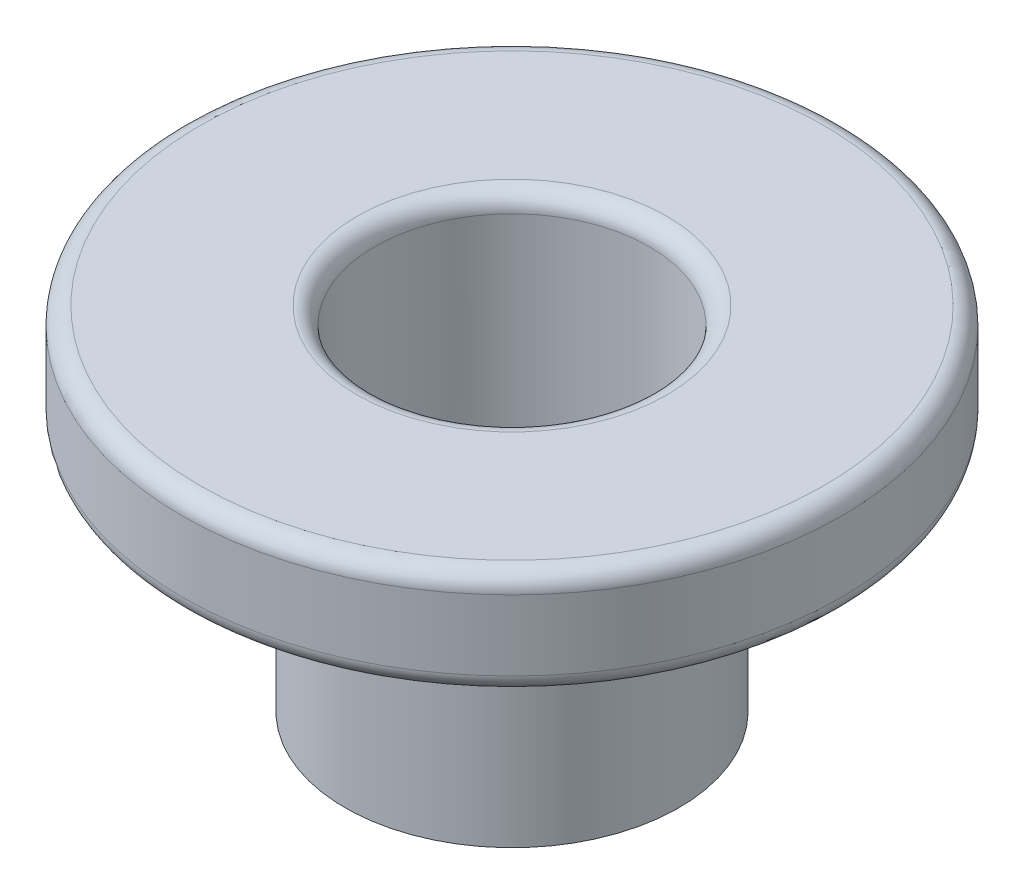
ISO-10303-21;
HEADER;
FILE_DESCRIPTION(('STEP AP214'),'2;1');
FILE_NAME('part.step','',(''),(''),'','','');
FILE_SCHEMA(('AUTOMOTIVE_DESIGN { 1 0 10303 214 1 1 1 1 }'));
ENDSEC;
DATA;
#1=APPLICATION_CONTEXT('core data for automotive mechanical design processes');
#2=APPLICATION_PROTOCOL_DEFINITION('international standard','automotive_design',2000,#1);
#3=PRODUCT_CONTEXT('',#1,'mechanical');
#4=PRODUCT('Part','Part','',(#3));
#5=PRODUCT_RELATED_PRODUCT_CATEGORY('part','',(#4));
#6=PRODUCT_DEFINITION_FORMATION('','',#4);
#7=PRODUCT_DEFINITION_CONTEXT('part definition',#1,'design');
#8=PRODUCT_DEFINITION('design','',#6,#7);
#9=PRODUCT_DEFINITION_SHAPE('','',#8);
#10=(LENGTH_UNIT() NAMED_UNIT(*) SI_UNIT(.MILLI.,.METRE.));
#11=(NAMED_UNIT(*) PLANE_ANGLE_UNIT() SI_UNIT($,.RADIAN.));
#12=(NAMED_UNIT(*) SI_UNIT($,.STERADIAN.) SOLID_ANGLE_UNIT());
#13=UNCERTAINTY_MEASURE_WITH_UNIT(LENGTH_MEASURE(1.E-05),#10,'distance_accuracy_value','');
#14=(GEOMETRIC_REPRESENTATION_CONTEXT(3) GLOBAL_UNCERTAINTY_ASSIGNED_CONTEXT((#13)) GLOBAL_UNIT_ASSIGNED_CONTEXT((#10,
#11,#12)) REPRESENTATION_CONTEXT('',''));
#15=CARTESIAN_POINT('',(0.,0.,0.));
#16=DIRECTION('',(0.,0.,1.));
#17=DIRECTION('',(1.,0.,0.));
#18=AXIS2_PLACEMENT_3D('',#15,#16,#17);
#19=CARTESIAN_POINT('',(2.413,0.,0.));
#20=DIRECTION('',(0.,-1.,0.));
#21=DIRECTION('',(0.,0.,-1.));
#22=AXIS2_PLACEMENT_3D('',#19,#20,#21);
#23=PLANE('',#22);
#24=CARTESIAN_POINT('',(0.,0.,0.));
#25=DIRECTION('',(0.,-1.,0.));
#26=DIRECTION('',(0.,0.,-1.));
#27=AXIS2_PLACEMENT_3D('',#24,#25,#26);
#28=CIRCLE('',#27,2.413);
#29=CARTESIAN_POINT('',(0.,0.,-2.413));
#30=VERTEX_POINT('',#29);
#31=EDGE_CURVE('E49',#30,#30,#28,.T.);
#32=ORIENTED_EDGE('',*,*,#31,.T.);
#33=EDGE_LOOP('',(#32));
#34=FACE_BOUND('',#33,.T.);
#35=CARTESIAN_POINT('',(0.,0.,0.));
#36=DIRECTION('',(0.,-1.,0.));
#37=DIRECTION('',(0.,0.,-1.));
#38=AXIS2_PLACEMENT_3D('',#35,#36,#37);
#39=CIRCLE('',#38,1.984375);
#40=CARTESIAN_POINT('',(0.,0.,-1.984375));
#41=VERTEX_POINT('',#40);
#42=EDGE_CURVE('E55',#41,#41,#39,.T.);
#43=ORIENTED_EDGE('',*,*,#42,.F.);
#44=EDGE_LOOP('',(#43));
#45=FACE_BOUND('',#44,.T.);
#46=ADVANCED_FACE('F24',(#34,#45),#23,.T.);
#47=CARTESIAN_POINT('',(0.,0.,0.));
#48=DIRECTION('',(0.,-1.,0.));
#49=DIRECTION('',(0.,0.,-1.));
#50=AXIS2_PLACEMENT_3D('',#47,#48,#49);
#51=CYLINDRICAL_SURFACE('',#50,2.413);
#52=CARTESIAN_POINT('',(0.,3.556,0.));
#53=DIRECTION('',(0.,-1.,0.));
#54=DIRECTION('',(0.,0.,-1.));
#55=AXIS2_PLACEMENT_3D('',#52,#53,#54);
#56=CIRCLE('',#55,2.413);
#57=CARTESIAN_POINT('',(0.,3.556,-2.413));
#58=VERTEX_POINT('',#57);
#59=EDGE_CURVE('E52',#58,#58,#56,.T.);
#60=ORIENTED_EDGE('',*,*,#59,.T.);
#61=EDGE_LOOP('',(#60));
#62=FACE_BOUND('',#61,.T.);
#63=ORIENTED_EDGE('',*,*,#31,.F.);
#64=EDGE_LOOP('',(#63));
#65=FACE_BOUND('',#64,.T.);
#66=ADVANCED_FACE('F62',(#62,#65),#51,.T.);
#67=CARTESIAN_POINT('',(4.7625,3.556,0.));
#68=DIRECTION('',(0.,-1.,0.));
#69=DIRECTION('',(0.,0.,-1.));
#70=AXIS2_PLACEMENT_3D('',#67,#68,#69);
#71=PLANE('',#70);
#72=CARTESIAN_POINT('',(0.,3.556,0.));
#73=DIRECTION('',(0.,-1.,0.));
#74=DIRECTION('',(0.,0.,-1.));
#75=AXIS2_PLACEMENT_3D('',#72,#73,#74);
#76=CIRCLE('',#75,4.5085);
#77=CARTESIAN_POINT('',(0.,3.556,-4.5085));
#78=VERTEX_POINT('',#77);
#79=EDGE_CURVE('E34',#78,#78,#76,.T.);
#80=ORIENTED_EDGE('',*,*,#79,.T.);
#81=EDGE_LOOP('',(#80));
#82=FACE_BOUND('',#81,.T.);
#83=ORIENTED_EDGE('',*,*,#59,.F.);
#84=EDGE_LOOP('',(#83));
#85=FACE_BOUND('',#84,.T.);
#86=ADVANCED_FACE('F67',(#82,#85),#71,.T.);
#87=CARTESIAN_POINT('',(0.,0.,0.));
#88=DIRECTION('',(0.,-1.,0.));
#89=DIRECTION('',(0.,0.,-1.));
#90=AXIS2_PLACEMENT_3D('',#87,#88,#89);
#91=CYLINDRICAL_SURFACE('',#90,4.7625);
#92=CARTESIAN_POINT('',(0.,3.81,0.));
#93=DIRECTION('',(0.,-1.,0.));
#94=DIRECTION('',(0.,0.,-1.));
#95=AXIS2_PLACEMENT_3D('',#92,#93,#94);
#96=CIRCLE('',#95,4.7625);
#97=CARTESIAN_POINT('',(0.,3.81,-4.7625));
#98=VERTEX_POINT('',#97);
#99=EDGE_CURVE('E10',#98,#98,#96,.F.);
#100=ORIENTED_EDGE('',*,*,#99,.T.);
#101=EDGE_LOOP('',(#100));
#102=FACE_BOUND('',#101,.T.);
#103=CARTESIAN_POINT('',(0.,4.826,0.));
#104=DIRECTION('',(0.,1.,0.));
#105=DIRECTION('',(0.,0.,1.));
#106=AXIS2_PLACEMENT_3D('',#103,#104,#105);
#107=CIRCLE('',#106,4.7625);
#108=CARTESIAN_POINT('',(0.,4.826,4.7625));
#109=VERTEX_POINT('',#108);
#110=EDGE_CURVE('E30',#109,#109,#107,.F.);
#111=ORIENTED_EDGE('',*,*,#110,.T.);
#112=EDGE_LOOP('',(#111));
#113=FACE_BOUND('',#112,.T.);
#114=ADVANCED_FACE('F74',(#102,#113),#91,.T.);
#115=CARTESIAN_POINT('',(1.984375,5.08,0.));
#116=DIRECTION('',(0.,1.,0.));
#117=DIRECTION('',(0.,0.,1.));
#118=AXIS2_PLACEMENT_3D('',#115,#116,#117);
#119=PLANE('',#118);
#120=CARTESIAN_POINT('',(0.,5.08,0.));
#121=DIRECTION('',(0.,1.,0.));
#122=DIRECTION('',(0.,0.,1.));
#123=AXIS2_PLACEMENT_3D('',#120,#121,#122);
#124=CIRCLE('',#123,2.238375);
#125=CARTESIAN_POINT('',(0.,5.08,2.238375));
#126=VERTEX_POINT('',#125);
#127=EDGE_CURVE('E43',#126,#126,#124,.F.);
#128=ORIENTED_EDGE('',*,*,#127,.T.);
#129=EDGE_LOOP('',(#128));
#130=FACE_BOUND('',#129,.T.);
#131=CARTESIAN_POINT('',(0.,5.08,0.));
#132=DIRECTION('',(0.,1.,0.));
#133=DIRECTION('',(0.,0.,1.));
#134=AXIS2_PLACEMENT_3D('',#131,#132,#133);
#135=CIRCLE('',#134,4.5085);
#136=CARTESIAN_POINT('',(0.,5.08,4.5085));
#137=VERTEX_POINT('',#136);
#138=EDGE_CURVE('E46',#137,#137,#135,.T.);
#139=ORIENTED_EDGE('',*,*,#138,.T.);
#140=EDGE_LOOP('',(#139));
#141=FACE_BOUND('',#140,.T.);
#142=ADVANCED_FACE('F80',(#130,#141),#119,.T.);
#143=CARTESIAN_POINT('',(0.,0.,0.));
#144=DIRECTION('',(0.,-1.,0.));
#145=DIRECTION('',(0.,0.,-1.));
#146=AXIS2_PLACEMENT_3D('',#143,#144,#145);
#147=CYLINDRICAL_SURFACE('',#146,1.984375);
#148=CARTESIAN_POINT('',(0.,4.826,0.));
#149=DIRECTION('',(0.,1.,0.));
#150=DIRECTION('',(0.,0.,1.));
#151=AXIS2_PLACEMENT_3D('',#148,#149,#150);
#152=CIRCLE('',#151,1.984375);
#153=CARTESIAN_POINT('',(0.,4.826,1.984375));
#154=VERTEX_POINT('',#153);
#155=EDGE_CURVE('E38',#154,#154,#152,.T.);
#156=ORIENTED_EDGE('',*,*,#155,.T.);
#157=EDGE_LOOP('',(#156));
#158=FACE_BOUND('',#157,.T.);
#159=ORIENTED_EDGE('',*,*,#42,.T.);
#160=EDGE_LOOP('',(#159));
#161=FACE_BOUND('',#160,.T.);
#162=ADVANCED_FACE('F59',(#158,#161),#147,.F.);
#163=CARTESIAN_POINT('',(0.,4.826,0.));
#164=DIRECTION('',(0.,1.,0.));
#165=DIRECTION('',(0.,0.,1.));
#166=AXIS2_PLACEMENT_3D('',#163,#164,#165);
#167=TOROIDAL_SURFACE('',#166,2.238375,0.254);
#168=ORIENTED_EDGE('',*,*,#155,.F.);
#169=EDGE_LOOP('',(#168));
#170=FACE_BOUND('',#169,.T.);
#171=ORIENTED_EDGE('',*,*,#127,.F.);
#172=EDGE_LOOP('',(#171));
#173=FACE_BOUND('',#172,.T.);
#174=ADVANCED_FACE('F86',(#170,#173),#167,.T.);
#175=CARTESIAN_POINT('',(0.,3.81,0.));
#176=DIRECTION('',(0.,-1.,0.));
#177=DIRECTION('',(0.,0.,-1.));
#178=AXIS2_PLACEMENT_3D('',#175,#176,#177);
#179=TOROIDAL_SURFACE('',#178,4.5085,0.254);
#180=ORIENTED_EDGE('',*,*,#99,.F.);
#181=EDGE_LOOP('',(#180));
#182=FACE_BOUND('',#181,.T.);
#183=ORIENTED_EDGE('',*,*,#79,.F.);
#184=EDGE_LOOP('',(#183));
#185=FACE_BOUND('',#184,.T.);
#186=ADVANCED_FACE('F90',(#182,#185),#179,.T.);
#187=CARTESIAN_POINT('',(0.,4.826,0.));
#188=DIRECTION('',(0.,1.,0.));
#189=DIRECTION('',(0.,0.,1.));
#190=AXIS2_PLACEMENT_3D('',#187,#188,#189);
#191=TOROIDAL_SURFACE('',#190,4.5085,0.254);
#192=ORIENTED_EDGE('',*,*,#138,.F.);
#193=EDGE_LOOP('',(#192));
#194=FACE_BOUND('',#193,.T.);
#195=ORIENTED_EDGE('',*,*,#110,.F.);
#196=EDGE_LOOP('',(#195));
#197=FACE_BOUND('',#196,.T.);
#198=ADVANCED_FACE('F94',(#194,#197),#191,.T.);
#199=CLOSED_SHELL('',(#46,#66,#86,#114,#142,#162,#174,#186,#198));
#200=MANIFOLD_SOLID_BREP('B2',#199);
#201=ADVANCED_BREP_SHAPE_REPRESENTATION('',(#18,#200),#14);
#202=SHAPE_DEFINITION_REPRESENTATION(#9,#201);
ENDSEC;
END-ISO-10303-21;
